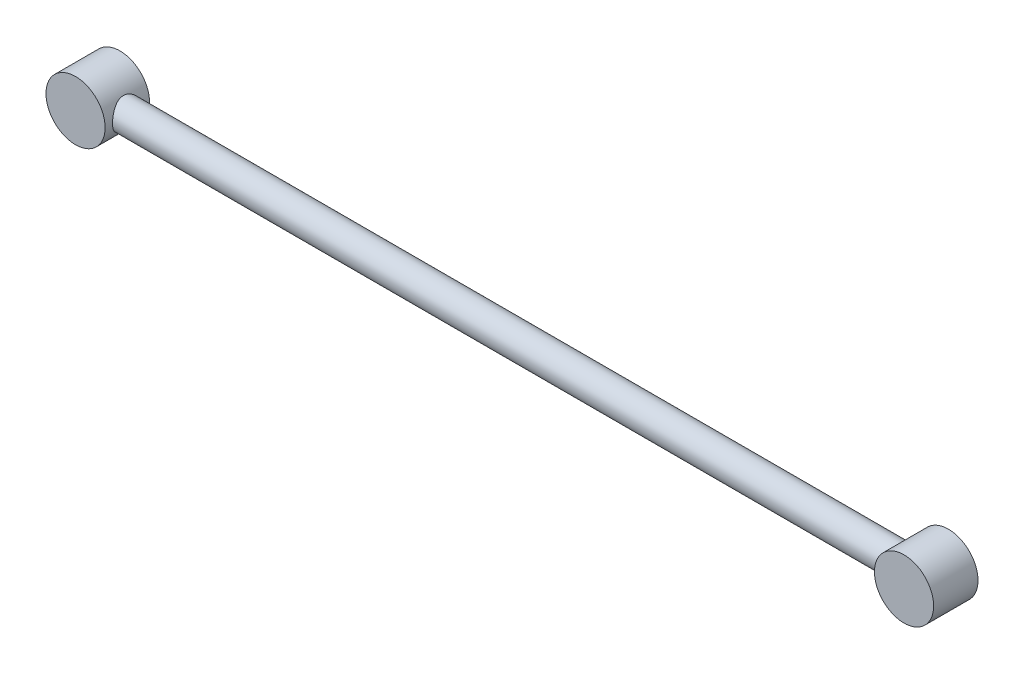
ISO-10303-21;
HEADER;
FILE_DESCRIPTION(('STEP AP214'),'2;1');
FILE_NAME('part.step','',(''),(''),'','','');
FILE_SCHEMA(('AUTOMOTIVE_DESIGN { 1 0 10303 214 1 1 1 1 }'));
ENDSEC;
DATA;
#1=APPLICATION_CONTEXT('core data for automotive mechanical design processes');
#2=APPLICATION_PROTOCOL_DEFINITION('international standard','automotive_design',2000,#1);
#3=PRODUCT_CONTEXT('',#1,'mechanical');
#4=PRODUCT('Part','Part','',(#3));
#5=PRODUCT_RELATED_PRODUCT_CATEGORY('part','',(#4));
#6=PRODUCT_DEFINITION_FORMATION('','',#4);
#7=PRODUCT_DEFINITION_CONTEXT('part definition',#1,'design');
#8=PRODUCT_DEFINITION('design','',#6,#7);
#9=PRODUCT_DEFINITION_SHAPE('','',#8);
#10=(LENGTH_UNIT() NAMED_UNIT(*) SI_UNIT(.MILLI.,.METRE.));
#11=(NAMED_UNIT(*) PLANE_ANGLE_UNIT() SI_UNIT($,.RADIAN.));
#12=(NAMED_UNIT(*) SI_UNIT($,.STERADIAN.) SOLID_ANGLE_UNIT());
#13=UNCERTAINTY_MEASURE_WITH_UNIT(LENGTH_MEASURE(1.E-05),#10,'distance_accuracy_value','');
#14=(GEOMETRIC_REPRESENTATION_CONTEXT(3) GLOBAL_UNCERTAINTY_ASSIGNED_CONTEXT((#13)) GLOBAL_UNIT_ASSIGNED_CONTEXT((#10,
#11,#12)) REPRESENTATION_CONTEXT('',''));
#15=CARTESIAN_POINT('',(0.,0.,0.));
#16=DIRECTION('',(0.,0.,1.));
#17=DIRECTION('',(1.,0.,0.));
#18=AXIS2_PLACEMENT_3D('',#15,#16,#17);
#19=CARTESIAN_POINT('',(-177.8,0.,9.52499999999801));
#20=DIRECTION('',(0.,0.,-1.));
#21=DIRECTION('',(-1.,0.,0.));
#22=AXIS2_PLACEMENT_3D('',#19,#20,#21);
#23=CYLINDRICAL_SURFACE('',#22,12.7);
#24=CARTESIAN_POINT('',(-165.099999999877,0.,-6.34999999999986));
#25=CARTESIAN_POINT('',(-165.100000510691,0.166990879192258,-6.34999944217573));
#26=CARTESIAN_POINT('',(-165.103301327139,0.333993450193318,-6.34340517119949));
#27=CARTESIAN_POINT('',(-165.116421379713,0.66676852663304,-6.31710332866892));
#28=CARTESIAN_POINT('',(-165.126243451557,0.832540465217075,-6.29739005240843));
#29=CARTESIAN_POINT('',(-165.152170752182,1.16177467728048,-6.24504620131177));
#30=CARTESIAN_POINT('',(-165.16828494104,1.32523331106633,-6.2123972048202));
#31=CARTESIAN_POINT('',(-165.206391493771,1.64849348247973,-6.13454367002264));
#32=CARTESIAN_POINT('',(-165.228386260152,1.80829349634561,-6.08933399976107));
#33=CARTESIAN_POINT('',(-165.277604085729,2.1224418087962,-5.98706118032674));
#34=CARTESIAN_POINT('',(-165.304804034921,2.2768107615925,-5.93005033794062));
#35=CARTESIAN_POINT('',(-165.363849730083,2.57993454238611,-5.80460027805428));
#36=CARTESIAN_POINT('',(-165.395697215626,2.72868724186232,-5.73615677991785));
#37=CARTESIAN_POINT('',(-165.497118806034,3.16512812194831,-5.51459167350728));
#38=CARTESIAN_POINT('',(-165.572628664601,3.4433450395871,-5.3451216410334));
#39=CARTESIAN_POINT('',(-165.737781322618,3.98471796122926,-4.95605749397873));
#40=CARTESIAN_POINT('',(-165.828002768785,4.2459445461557,-4.73405124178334));
#41=CARTESIAN_POINT('',(-166.010603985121,4.72936553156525,-4.25114819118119));
#42=CARTESIAN_POINT('',(-166.102985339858,4.95153018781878,-3.99022203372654));
#43=CARTESIAN_POINT('',(-166.239675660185,5.25955398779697,-3.56282486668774));
#44=CARTESIAN_POINT('',(-166.286527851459,5.36106270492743,-3.40820389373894));
#45=CARTESIAN_POINT('',(-166.376690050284,5.55058368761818,-3.08994761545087));
#46=CARTESIAN_POINT('',(-166.420001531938,5.63860158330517,-2.92631610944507));
#47=CARTESIAN_POINT('',(-166.501590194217,5.80035808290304,-2.59094786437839));
#48=CARTESIAN_POINT('',(-166.539867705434,5.87409762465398,-2.41921165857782));
#49=CARTESIAN_POINT('',(-166.609911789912,6.00645788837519,-2.06881694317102));
#50=CARTESIAN_POINT('',(-166.641682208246,6.06508754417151,-1.89016259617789));
#51=CARTESIAN_POINT('',(-166.695740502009,6.16347180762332,-1.53802379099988));
#52=CARTESIAN_POINT('',(-166.718480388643,6.20414249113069,-1.36486498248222));
#53=CARTESIAN_POINT('',(-166.756119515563,6.2708994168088,-1.014910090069));
#54=CARTESIAN_POINT('',(-166.771019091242,6.29698628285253,-0.838114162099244));
#55=CARTESIAN_POINT('',(-166.792323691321,6.33415533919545,-0.482590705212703));
#56=CARTESIAN_POINT('',(-166.79873590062,6.34525022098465,-0.303864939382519));
#57=CARTESIAN_POINT('',(-166.802799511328,6.35229110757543,0.0539765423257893));
#58=CARTESIAN_POINT('',(-166.800451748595,6.34823855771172,0.233092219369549));
#59=CARTESIAN_POINT('',(-166.787909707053,6.32645177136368,0.568582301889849));
#60=CARTESIAN_POINT('',(-166.77869041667,6.31041699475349,0.725107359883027));
#61=CARTESIAN_POINT('',(-166.753871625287,6.26687134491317,1.03609053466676));
#62=CARTESIAN_POINT('',(-166.738270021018,6.23935668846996,1.1905479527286));
#63=CARTESIAN_POINT('',(-166.701197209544,6.17316873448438,1.4963112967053));
#64=CARTESIAN_POINT('',(-166.679726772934,6.13449690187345,1.64761763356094));
#65=CARTESIAN_POINT('',(-166.631580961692,6.04639785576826,1.94623864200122));
#66=CARTESIAN_POINT('',(-166.604903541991,5.99696641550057,2.09355171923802));
#67=CARTESIAN_POINT('',(-166.516862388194,5.83067999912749,2.53492872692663));
#68=CARTESIAN_POINT('',(-166.44837434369,5.69733157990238,2.82155056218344));
#69=CARTESIAN_POINT('',(-166.299928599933,5.39139880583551,3.36957685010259));
#70=CARTESIAN_POINT('',(-166.219965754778,5.21879682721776,3.63096990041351));
#71=CARTESIAN_POINT('',(-166.045318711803,4.81373716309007,4.15618743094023));
#72=CARTESIAN_POINT('',(-165.950053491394,4.57646495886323,4.41611767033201));
#73=CARTESIAN_POINT('',(-165.763714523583,4.06112275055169,4.89420340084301));
#74=CARTESIAN_POINT('',(-165.672642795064,3.78303336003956,5.11233892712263));
#75=CARTESIAN_POINT('',(-165.544061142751,3.33286643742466,5.40822137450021));
#76=CARTESIAN_POINT('',(-165.501694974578,3.17335722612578,5.50335984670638));
#77=CARTESIAN_POINT('',(-165.421778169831,2.84569771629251,5.67970671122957));
#78=CARTESIAN_POINT('',(-165.384225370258,2.67755134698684,5.76092136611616));
#79=CARTESIAN_POINT('',(-165.315042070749,2.3337876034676,5.90854657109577));
#80=CARTESIAN_POINT('',(-165.283409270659,2.15817316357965,5.97496287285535));
#81=CARTESIAN_POINT('',(-165.227012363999,1.8007480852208,6.09222165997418));
#82=CARTESIAN_POINT('',(-165.202247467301,1.61893816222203,6.14306593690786));
#83=CARTESIAN_POINT('',(-165.162108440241,1.26593635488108,6.22494695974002));
#84=CARTESIAN_POINT('',(-165.146126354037,1.09511243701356,6.25727558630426));
#85=CARTESIAN_POINT('',(-165.121043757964,0.750891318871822,6.30784558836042));
#86=CARTESIAN_POINT('',(-165.111942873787,0.577494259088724,6.32608773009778));
#87=CARTESIAN_POINT('',(-165.100884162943,0.229629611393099,6.34823872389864));
#88=CARTESIAN_POINT('',(-165.098923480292,0.0551624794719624,6.35215330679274));
#89=CARTESIAN_POINT('',(-165.102194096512,-0.293430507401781,6.34561139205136));
#90=CARTESIAN_POINT('',(-165.107425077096,-0.467556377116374,6.33515553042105));
#91=CARTESIAN_POINT('',(-165.124244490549,-0.800509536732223,6.30138636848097));
#92=CARTESIAN_POINT('',(-165.135306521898,-0.959472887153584,6.27913692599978));
#93=CARTESIAN_POINT('',(-165.163154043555,-1.27482840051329,6.22277883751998));
#94=CARTESIAN_POINT('',(-165.179941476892,-1.43121967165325,6.18866616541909));
#95=CARTESIAN_POINT('',(-165.2188400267,-1.74030776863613,6.10895204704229));
#96=CARTESIAN_POINT('',(-165.240949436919,-1.89300576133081,6.06335428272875));
#97=CARTESIAN_POINT('',(-165.290002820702,-2.19390570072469,5.96108560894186));
#98=CARTESIAN_POINT('',(-165.316948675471,-2.34210587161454,5.90441038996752));
#99=CARTESIAN_POINT('',(-165.375904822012,-2.63725856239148,5.77873770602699));
#100=CARTESIAN_POINT('',(-165.408036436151,-2.7840582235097,5.70943799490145));
#101=CARTESIAN_POINT('',(-165.476074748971,-3.07126756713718,5.56021860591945));
#102=CARTESIAN_POINT('',(-165.511982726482,-3.21167506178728,5.48029532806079));
#103=CARTESIAN_POINT('',(-165.624225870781,-3.62227376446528,5.22545088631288));
#104=CARTESIAN_POINT('',(-165.705112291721,-3.88199540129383,5.03538892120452));
#105=CARTESIAN_POINT('',(-165.880550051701,-4.39279994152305,4.59886015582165));
#106=CARTESIAN_POINT('',(-165.975663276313,-4.64052990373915,4.34868719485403));
#107=CARTESIAN_POINT('',(-166.116022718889,-4.97892395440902,3.94508991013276));
#108=CARTESIAN_POINT('',(-166.16245674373,-5.08625380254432,3.80572389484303));
#109=CARTESIAN_POINT('',(-166.253326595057,-5.28929908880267,3.51806625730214));
#110=CARTESIAN_POINT('',(-166.297762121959,-5.3850127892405,3.36977330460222));
#111=CARTESIAN_POINT('',(-166.385416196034,-5.56849389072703,3.05757189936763));
#112=CARTESIAN_POINT('',(-166.428469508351,-5.65564549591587,2.89325455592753));
#113=CARTESIAN_POINT('',(-166.509420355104,-5.81556909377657,2.55662946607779));
#114=CARTESIAN_POINT('',(-166.547320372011,-5.88834801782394,2.38432562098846));
#115=CARTESIAN_POINT('',(-166.616502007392,-6.01870593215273,2.0329208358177));
#116=CARTESIAN_POINT('',(-166.64778893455,-6.07629712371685,1.85382548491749));
#117=CARTESIAN_POINT('',(-166.702450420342,-6.17556605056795,1.49010166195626));
#118=CARTESIAN_POINT('',(-166.72582620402,-6.21724624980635,1.30547405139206));
#119=CARTESIAN_POINT('',(-166.761778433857,-6.28083303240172,0.950261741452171));
#120=CARTESIAN_POINT('',(-166.775176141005,-6.30425367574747,0.780030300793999));
#121=CARTESIAN_POINT('',(-166.794093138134,-6.33722186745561,0.437794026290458));
#122=CARTESIAN_POINT('',(-166.79961296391,-6.34677035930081,0.265789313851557));
#123=CARTESIAN_POINT('',(-166.802543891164,-6.35184755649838,-0.0784312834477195));
#124=CARTESIAN_POINT('',(-166.799957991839,-6.34738144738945,-0.250647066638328));
#125=CARTESIAN_POINT('',(-166.78679264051,-6.32451076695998,-0.59383366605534));
#126=CARTESIAN_POINT('',(-166.776213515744,-6.30610676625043,-0.764804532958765));
#127=CARTESIAN_POINT('',(-166.748868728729,-6.25804920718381,-1.08782968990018));
#128=CARTESIAN_POINT('',(-166.732791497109,-6.22963986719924,-1.2401293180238));
#129=CARTESIAN_POINT('',(-166.694973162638,-6.16196939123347,-1.54160036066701));
#130=CARTESIAN_POINT('',(-166.673230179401,-6.12270465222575,-1.69077071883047));
#131=CARTESIAN_POINT('',(-166.600451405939,-5.98919755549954,-2.13222433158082));
#132=CARTESIAN_POINT('',(-166.541846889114,-5.87921095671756,-2.41865701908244));
#133=CARTESIAN_POINT('',(-166.406284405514,-5.61221709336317,-2.98851600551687));
#134=CARTESIAN_POINT('',(-166.328357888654,-5.45254719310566,-3.27044739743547));
#135=CARTESIAN_POINT('',(-166.164560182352,-5.09367320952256,-3.80537307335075));
#136=CARTESIAN_POINT('',(-166.078684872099,-4.89444855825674,-4.05835219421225));
#137=CARTESIAN_POINT('',(-165.896130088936,-4.43354035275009,-4.5602382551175));
#138=CARTESIAN_POINT('',(-165.799405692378,-4.16720894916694,-4.80491543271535));
#139=CARTESIAN_POINT('',(-165.661668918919,-3.73813634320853,-5.13630604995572));
#140=CARTESIAN_POINT('',(-165.616947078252,-3.59004569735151,-5.24090509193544));
#141=CARTESIAN_POINT('',(-165.531112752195,-3.28473589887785,-5.4374551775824));
#142=CARTESIAN_POINT('',(-165.489998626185,-3.12752095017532,-5.52941198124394));
#143=CARTESIAN_POINT('',(-165.412194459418,-2.80361177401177,-5.70053310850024));
#144=CARTESIAN_POINT('',(-165.37554080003,-2.6368540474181,-5.7795938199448));
#145=CARTESIAN_POINT('',(-165.308088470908,-2.29614399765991,-5.92320628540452));
#146=CARTESIAN_POINT('',(-165.277286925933,-2.12219525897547,-5.98776516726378));
#147=CARTESIAN_POINT('',(-165.222499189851,-1.76872534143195,-6.1015167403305));
#148=CARTESIAN_POINT('',(-165.198498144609,-1.58921727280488,-6.15074294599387));
#149=CARTESIAN_POINT('',(-165.157980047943,-1.22585054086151,-6.23333526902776));
#150=CARTESIAN_POINT('',(-165.14145842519,-1.0419946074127,-6.26671107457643));
#151=CARTESIAN_POINT('',(-165.119349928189,-0.715063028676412,-6.31123256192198));
#152=CARTESIAN_POINT('',(-165.112106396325,-0.572548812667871,-6.3257579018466));
#153=CARTESIAN_POINT('',(-165.102431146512,-0.286692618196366,-6.34514199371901));
#154=CARTESIAN_POINT('',(-165.099999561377,-0.143350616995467,-6.35000047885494));
#155=CARTESIAN_POINT('',(-165.099999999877,0.,-6.34999999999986));
#156=B_SPLINE_CURVE_WITH_KNOTS('',3,(#24,#25,#26,#27,#28,#29,#30,#31,#32,#33,#34,#35,#36,#37,
#38,#39,#40,#41,#42,#43,#44,#45,#46,#47,#48,#49,#50,#51,#52,#53,#54,#55,#56,#57,#58,#59,#60,#61,
#62,#63,#64,#65,#66,#67,#68,#69,#70,#71,#72,#73,#74,#75,#76,#77,#78,#79,#80,#81,#82,#83,#84,#85,
#86,#87,#88,#89,#90,#91,#92,#93,#94,#95,#96,#97,#98,#99,#100,#101,#102,#103,#104,#105,#106,#107,
#108,#109,#110,#111,#112,#113,#114,#115,#116,#117,#118,#119,#120,#121,#122,#123,#124,#125,#126,
#127,#128,#129,#130,#131,#132,#133,#134,#135,#136,#137,#138,#139,#140,#141,#142,#143,#144,#145,
#146,#147,#148,#149,#150,#151,#152,#153,#154,#155),.UNSPECIFIED.,.T.,.F.,(4,2,2,2,2,2,2,2,2,2,2,
2,2,2,2,2,2,2,2,2,2,2,2,2,2,2,2,2,2,2,2,2,2,2,2,2,2,2,2,2,2,2,2,2,2,2,2,2,2,2,2,2,2,2,2,2,2,2,2,
2,2,2,2,2,2,4),(0.,0.500831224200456,1.00188037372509,1.50364564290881,2.00561622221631,
2.50540779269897,3.00538691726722,4.00425210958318,5.0635463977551,6.12364383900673,
6.69546056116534,7.26703799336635,7.83857787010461,8.40977904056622,8.94696617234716,
9.48413032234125,10.0208394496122,10.5574973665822,11.0297819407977,11.5022222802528,
11.9746006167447,12.4471648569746,13.4133450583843,14.3799599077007,15.4691385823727,
16.5588362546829,17.1296896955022,17.7002857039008,18.2706595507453,18.840967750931,
19.3640345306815,19.8870728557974,20.4099019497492,20.9327079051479,21.4148301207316,
21.8971161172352,22.3792476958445,22.8615672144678,23.3574791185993,23.8535595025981,
24.8452132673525,25.9342484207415,26.4795520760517,27.0249372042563,27.596939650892,
28.1686655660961,28.7399307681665,29.3111074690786,29.8274552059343,30.3437678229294,
30.8598894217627,31.3759898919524,31.8427315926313,32.3096283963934,33.2427989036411,
34.2386648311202,35.235049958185,36.3525027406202,36.9121724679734,37.4715863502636,
38.035294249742,38.5987244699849,39.1609143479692,39.7227601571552,40.1526787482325,
40.5826092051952),.UNSPECIFIED.);
#157=CARTESIAN_POINT('',(-165.099999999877,0.,-6.34999999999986));
#158=VERTEX_POINT('',#157);
#159=EDGE_CURVE('E54',#158,#158,#156,.T.);
#160=ORIENTED_EDGE('',*,*,#159,.F.);
#161=EDGE_LOOP('',(#160));
#162=FACE_BOUND('',#161,.T.);
#163=CARTESIAN_POINT('',(-177.8,0.,9.52499999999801));
#164=DIRECTION('',(0.,0.,1.));
#165=DIRECTION('',(1.,0.,0.));
#166=AXIS2_PLACEMENT_3D('',#163,#164,#165);
#167=CIRCLE('',#166,12.7);
#168=CARTESIAN_POINT('',(-165.1,0.,9.52499999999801));
#169=VERTEX_POINT('',#168);
#170=EDGE_CURVE('E12',#169,#169,#167,.T.);
#171=ORIENTED_EDGE('',*,*,#170,.F.);
#172=EDGE_LOOP('',(#171));
#173=FACE_BOUND('',#172,.T.);
#174=CARTESIAN_POINT('',(-177.8,0.,-9.52499999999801));
#175=DIRECTION('',(0.,0.,1.));
#176=DIRECTION('',(1.,0.,0.));
#177=AXIS2_PLACEMENT_3D('',#174,#175,#176);
#178=CIRCLE('',#177,12.7);
#179=CARTESIAN_POINT('',(-165.1,0.,-9.52499999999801));
#180=VERTEX_POINT('',#179);
#181=EDGE_CURVE('E47',#180,#180,#178,.T.);
#182=ORIENTED_EDGE('',*,*,#181,.T.);
#183=EDGE_LOOP('',(#182));
#184=FACE_BOUND('',#183,.T.);
#185=ADVANCED_FACE('F44',(#162,#173,#184),#23,.T.);
#186=CARTESIAN_POINT('',(-177.8,0.,9.52499999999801));
#187=DIRECTION('',(0.,0.,1.));
#188=DIRECTION('',(1.,0.,0.));
#189=AXIS2_PLACEMENT_3D('',#186,#187,#188);
#190=PLANE('',#189);
#191=ORIENTED_EDGE('',*,*,#170,.T.);
#192=EDGE_LOOP('',(#191));
#193=FACE_BOUND('',#192,.T.);
#194=ADVANCED_FACE('F72',(#193),#190,.T.);
#195=CARTESIAN_POINT('',(-177.8,0.,-9.52499999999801));
#196=DIRECTION('',(0.,0.,1.));
#197=DIRECTION('',(1.,0.,0.));
#198=AXIS2_PLACEMENT_3D('',#195,#196,#197);
#199=PLANE('',#198);
#200=ORIENTED_EDGE('',*,*,#181,.F.);
#201=EDGE_LOOP('',(#200));
#202=FACE_BOUND('',#201,.T.);
#203=ADVANCED_FACE('F74',(#202),#199,.F.);
#204=CARTESIAN_POINT('',(-500000.,0.,0.));
#205=DIRECTION('',(1.,0.,0.));
#206=DIRECTION('',(0.,0.,-1.));
#207=AXIS2_PLACEMENT_3D('',#204,#205,#206);
#208=CYLINDRICAL_SURFACE('',#207,6.35);
#209=ORIENTED_EDGE('',*,*,#159,.T.);
#210=EDGE_LOOP('',(#209));
#211=FACE_BOUND('',#210,.T.);
#212=CARTESIAN_POINT('',(165.099999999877,0.,6.34999999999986));
#213=CARTESIAN_POINT('',(165.100000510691,-0.166990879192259,6.34999944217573));
#214=CARTESIAN_POINT('',(165.103301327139,-0.33399345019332,6.34340517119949));
#215=CARTESIAN_POINT('',(165.116421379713,-0.666768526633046,6.31710332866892));
#216=CARTESIAN_POINT('',(165.126243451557,-0.832540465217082,6.29739005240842));
#217=CARTESIAN_POINT('',(165.152170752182,-1.16177467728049,6.24504620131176));
#218=CARTESIAN_POINT('',(165.16828494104,-1.32523331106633,6.2123972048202));
#219=CARTESIAN_POINT('',(165.206391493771,-1.64849348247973,6.13454367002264));
#220=CARTESIAN_POINT('',(165.228386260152,-1.80829349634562,6.08933399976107));
#221=CARTESIAN_POINT('',(165.277604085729,-2.1224418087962,5.98706118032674));
#222=CARTESIAN_POINT('',(165.304804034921,-2.27681076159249,5.93005033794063));
#223=CARTESIAN_POINT('',(165.363849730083,-2.57993454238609,5.80460027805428));
#224=CARTESIAN_POINT('',(165.395697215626,-2.72868724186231,5.73615677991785));
#225=CARTESIAN_POINT('',(165.497118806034,-3.1651281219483,5.51459167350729));
#226=CARTESIAN_POINT('',(165.572628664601,-3.44334503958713,5.34512164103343));
#227=CARTESIAN_POINT('',(165.737781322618,-3.98471796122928,4.95605749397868));
#228=CARTESIAN_POINT('',(165.828002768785,-4.24594454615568,4.73405124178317));
#229=CARTESIAN_POINT('',(166.010603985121,-4.72936553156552,4.25114819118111));
#230=CARTESIAN_POINT('',(166.102985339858,-4.95153018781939,3.99022203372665));
#231=CARTESIAN_POINT('',(166.239675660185,-5.25955398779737,3.56282486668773));
#232=CARTESIAN_POINT('',(166.286527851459,-5.3610627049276,3.40820389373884));
#233=CARTESIAN_POINT('',(166.376690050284,-5.55058368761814,3.08994761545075));
#234=CARTESIAN_POINT('',(166.420001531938,-5.63860158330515,2.926316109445));
#235=CARTESIAN_POINT('',(166.501590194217,-5.80035808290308,2.59094786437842));
#236=CARTESIAN_POINT('',(166.539867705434,-5.87409762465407,2.41921165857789));
#237=CARTESIAN_POINT('',(166.609911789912,-6.00645788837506,2.06881694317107));
#238=CARTESIAN_POINT('',(166.641682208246,-6.0650875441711,1.89016259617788));
#239=CARTESIAN_POINT('',(166.695740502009,-6.16347180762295,1.53802379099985));
#240=CARTESIAN_POINT('',(166.718480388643,-6.20414249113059,1.36486498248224));
#241=CARTESIAN_POINT('',(166.756119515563,-6.27089941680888,1.01491009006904));
#242=CARTESIAN_POINT('',(166.771019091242,-6.29698628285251,0.83811416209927));
#243=CARTESIAN_POINT('',(166.792323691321,-6.33415533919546,0.482590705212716));
#244=CARTESIAN_POINT('',(166.79873590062,-6.34525022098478,0.303864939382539));
#245=CARTESIAN_POINT('',(166.802799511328,-6.35229110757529,-0.0539765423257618));
#246=CARTESIAN_POINT('',(166.800451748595,-6.3482385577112,-0.233092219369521));
#247=CARTESIAN_POINT('',(166.787909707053,-6.3264517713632,-0.568582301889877));
#248=CARTESIAN_POINT('',(166.77869041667,-6.31041699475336,-0.725107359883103));
#249=CARTESIAN_POINT('',(166.753871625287,-6.26687134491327,-1.03609053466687));
#250=CARTESIAN_POINT('',(166.738270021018,-6.23935668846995,-1.19054795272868));
#251=CARTESIAN_POINT('',(166.701197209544,-6.17316873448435,-1.4963112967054));
#252=CARTESIAN_POINT('',(166.679726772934,-6.13449690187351,-1.64761763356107));
#253=CARTESIAN_POINT('',(166.631580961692,-6.04639785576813,-1.94623864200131));
#254=CARTESIAN_POINT('',(166.604903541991,-5.99696641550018,-2.09355171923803));
#255=CARTESIAN_POINT('',(166.516862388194,-5.83067999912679,-2.53492872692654));
#256=CARTESIAN_POINT('',(166.44837434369,-5.69733157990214,-2.82155056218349));
#257=CARTESIAN_POINT('',(166.299928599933,-5.39139880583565,-3.36957685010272));
#258=CARTESIAN_POINT('',(166.219965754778,-5.2187968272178,-3.63096990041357));
#259=CARTESIAN_POINT('',(166.045318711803,-4.81373716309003,-4.15618743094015));
#260=CARTESIAN_POINT('',(165.950053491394,-4.57646495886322,-4.41611767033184));
#261=CARTESIAN_POINT('',(165.763714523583,-4.06112275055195,-4.89420340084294));
#262=CARTESIAN_POINT('',(165.672642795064,-3.78303336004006,-5.11233892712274));
#263=CARTESIAN_POINT('',(165.544061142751,-3.33286643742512,-5.40822137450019));
#264=CARTESIAN_POINT('',(165.501694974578,-3.17335722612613,-5.50335984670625));
#265=CARTESIAN_POINT('',(165.421778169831,-2.84569771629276,-5.67970671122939));
#266=CARTESIAN_POINT('',(165.384225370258,-2.67755134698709,-5.76092136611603));
#267=CARTESIAN_POINT('',(165.315042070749,-2.3337876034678,-5.90854657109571));
#268=CARTESIAN_POINT('',(165.283409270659,-2.15817316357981,-5.9749628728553));
#269=CARTESIAN_POINT('',(165.227012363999,-1.80074808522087,-6.09222165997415));
#270=CARTESIAN_POINT('',(165.202247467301,-1.61893816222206,-6.14306593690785));
#271=CARTESIAN_POINT('',(165.162108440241,-1.26593635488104,-6.22494695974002));
#272=CARTESIAN_POINT('',(165.146126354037,-1.09511243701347,-6.25727558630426));
#273=CARTESIAN_POINT('',(165.121043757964,-0.750891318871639,-6.30784558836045));
#274=CARTESIAN_POINT('',(165.111942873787,-0.577494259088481,-6.32608773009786));
#275=CARTESIAN_POINT('',(165.100884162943,-0.229629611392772,-6.3482387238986));
#276=CARTESIAN_POINT('',(165.098923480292,-0.0551624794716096,-6.35215330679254));
#277=CARTESIAN_POINT('',(165.102194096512,0.29343050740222,-6.34561139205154));
#278=CARTESIAN_POINT('',(165.107425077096,0.467556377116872,-6.33515553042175));
#279=CARTESIAN_POINT('',(165.124244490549,0.800509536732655,-6.30138636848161));
#280=CARTESIAN_POINT('',(165.135306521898,0.959472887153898,-6.27913692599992));
#281=CARTESIAN_POINT('',(165.163154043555,1.27482840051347,-6.22277883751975));
#282=CARTESIAN_POINT('',(165.179941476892,1.43121967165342,-6.188666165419));
#283=CARTESIAN_POINT('',(165.2188400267,1.74030776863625,-6.10895204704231));
#284=CARTESIAN_POINT('',(165.240949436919,1.8930057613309,-6.06335428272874));
#285=CARTESIAN_POINT('',(165.290002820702,2.19390570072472,-5.96108560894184));
#286=CARTESIAN_POINT('',(165.316948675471,2.34210587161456,-5.90441038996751));
#287=CARTESIAN_POINT('',(165.375904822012,2.63725856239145,-5.778737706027));
#288=CARTESIAN_POINT('',(165.408036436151,2.78405822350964,-5.70943799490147));
#289=CARTESIAN_POINT('',(165.476074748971,3.07126756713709,-5.5602186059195));
#290=CARTESIAN_POINT('',(165.511982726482,3.21167506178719,-5.48029532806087));
#291=CARTESIAN_POINT('',(165.624225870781,3.62227376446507,-5.22545088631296));
#292=CARTESIAN_POINT('',(165.705112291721,3.88199540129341,-5.03538892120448));
#293=CARTESIAN_POINT('',(165.880550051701,4.3927999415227,-4.5988601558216));
#294=CARTESIAN_POINT('',(165.975663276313,4.64052990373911,-4.34868719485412));
#295=CARTESIAN_POINT('',(166.116022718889,4.97892395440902,-3.94508991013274));
#296=CARTESIAN_POINT('',(166.16245674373,5.08625380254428,-3.80572389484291));
#297=CARTESIAN_POINT('',(166.253326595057,5.28929908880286,-3.51806625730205));
#298=CARTESIAN_POINT('',(166.297762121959,5.38501278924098,-3.36977330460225));
#299=CARTESIAN_POINT('',(166.385416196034,5.56849389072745,-3.05757189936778));
#300=CARTESIAN_POINT('',(166.428469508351,5.65564549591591,-2.89325455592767));
#301=CARTESIAN_POINT('',(166.509420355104,5.81556909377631,-2.55662946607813));
#302=CARTESIAN_POINT('',(166.547320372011,5.88834801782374,-2.384325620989));
#303=CARTESIAN_POINT('',(166.616502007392,6.0187059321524,-2.03292083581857));
#304=CARTESIAN_POINT('',(166.64778893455,6.07629712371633,-1.85382548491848));
#305=CARTESIAN_POINT('',(166.702450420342,6.1755660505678,-1.49010166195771));
#306=CARTESIAN_POINT('',(166.72582620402,6.21724624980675,-1.30547405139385));
#307=CARTESIAN_POINT('',(166.761778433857,6.28083303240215,-0.950261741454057));
#308=CARTESIAN_POINT('',(166.775176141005,6.30425367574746,-0.780030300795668));
#309=CARTESIAN_POINT('',(166.794093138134,6.33722186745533,-0.437794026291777));
#310=CARTESIAN_POINT('',(166.79961296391,6.34677035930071,-0.265789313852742));
#311=CARTESIAN_POINT('',(166.802543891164,6.35184755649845,0.0784312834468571));
#312=CARTESIAN_POINT('',(166.799957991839,6.3473814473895,0.250647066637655));
#313=CARTESIAN_POINT('',(166.78679264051,6.32451076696,0.593833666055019));
#314=CARTESIAN_POINT('',(166.776213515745,6.30610676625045,0.764804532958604));
#315=CARTESIAN_POINT('',(166.748868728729,6.25804920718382,1.08782968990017));
#316=CARTESIAN_POINT('',(166.732791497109,6.22963986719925,1.24012931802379));
#317=CARTESIAN_POINT('',(166.694973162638,6.16196939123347,1.54160036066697));
#318=CARTESIAN_POINT('',(166.673230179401,6.12270465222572,1.69077071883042));
#319=CARTESIAN_POINT('',(166.600451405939,5.98919755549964,2.13222433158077));
#320=CARTESIAN_POINT('',(166.541846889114,5.87921095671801,2.41865701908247));
#321=CARTESIAN_POINT('',(166.406284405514,5.6122170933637,2.98851600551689));
#322=CARTESIAN_POINT('',(166.328357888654,5.45254719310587,3.27044739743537));
#323=CARTESIAN_POINT('',(166.164560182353,5.09367320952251,3.80537307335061));
#324=CARTESIAN_POINT('',(166.078684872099,4.89444855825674,4.0583521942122));
#325=CARTESIAN_POINT('',(165.896130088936,4.43354035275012,4.56023825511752));
#326=CARTESIAN_POINT('',(165.799405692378,4.16720894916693,4.80491543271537));
#327=CARTESIAN_POINT('',(165.661668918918,3.73813634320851,5.13630604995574));
#328=CARTESIAN_POINT('',(165.616947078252,3.59004569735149,5.24090509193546));
#329=CARTESIAN_POINT('',(165.531112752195,3.28473589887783,5.43745517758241));
#330=CARTESIAN_POINT('',(165.489998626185,3.12752095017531,5.52941198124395));
#331=CARTESIAN_POINT('',(165.412194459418,2.80361177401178,5.70053310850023));
#332=CARTESIAN_POINT('',(165.37554080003,2.6368540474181,5.7795938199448));
#333=CARTESIAN_POINT('',(165.308088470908,2.29614399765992,5.92320628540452));
#334=CARTESIAN_POINT('',(165.277286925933,2.12219525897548,5.98776516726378));
#335=CARTESIAN_POINT('',(165.222499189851,1.76872534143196,6.10151674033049));
#336=CARTESIAN_POINT('',(165.198498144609,1.58921727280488,6.15074294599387));
#337=CARTESIAN_POINT('',(165.157980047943,1.22585054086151,6.23333526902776));
#338=CARTESIAN_POINT('',(165.14145842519,1.0419946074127,6.26671107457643));
#339=CARTESIAN_POINT('',(165.119349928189,0.715063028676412,6.31123256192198));
#340=CARTESIAN_POINT('',(165.112106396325,0.572548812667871,6.3257579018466));
#341=CARTESIAN_POINT('',(165.102431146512,0.286692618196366,6.34514199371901));
#342=CARTESIAN_POINT('',(165.099999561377,0.143350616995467,6.35000047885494));
#343=CARTESIAN_POINT('',(165.099999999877,0.,6.34999999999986));
#344=B_SPLINE_CURVE_WITH_KNOTS('',3,(#212,#213,#214,#215,#216,#217,#218,#219,#220,#221,#222,
#223,#224,#225,#226,#227,#228,#229,#230,#231,#232,#233,#234,#235,#236,#237,#238,#239,#240,#241,
#242,#243,#244,#245,#246,#247,#248,#249,#250,#251,#252,#253,#254,#255,#256,#257,#258,#259,#260,
#261,#262,#263,#264,#265,#266,#267,#268,#269,#270,#271,#272,#273,#274,#275,#276,#277,#278,#279,
#280,#281,#282,#283,#284,#285,#286,#287,#288,#289,#290,#291,#292,#293,#294,#295,#296,#297,#298,
#299,#300,#301,#302,#303,#304,#305,#306,#307,#308,#309,#310,#311,#312,#313,#314,#315,#316,#317,
#318,#319,#320,#321,#322,#323,#324,#325,#326,#327,#328,#329,#330,#331,#332,#333,#334,#335,#336,
#337,#338,#339,#340,#341,#342,#343),.UNSPECIFIED.,.T.,.F.,(4,2,2,2,2,2,2,2,2,2,2,2,2,2,2,2,2,2,
2,2,2,2,2,2,2,2,2,2,2,2,2,2,2,2,2,2,2,2,2,2,2,2,2,2,2,2,2,2,2,2,2,2,2,2,2,2,2,2,2,2,2,2,2,2,2,
4),(0.,0.50083122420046,1.0018803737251,1.50364564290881,2.00561622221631,2.50540779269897,
3.0053869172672,4.00425210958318,5.0635463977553,6.12364383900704,6.69546056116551,
7.26703799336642,7.8385778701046,8.40977904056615,8.94696617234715,9.48413032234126,
10.0208394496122,10.5574973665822,11.0297819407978,11.5022222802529,11.9746006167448,
12.4471648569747,13.4133450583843,14.3799599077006,15.4691385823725,16.5588362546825,
17.1296896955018,17.7002857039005,18.2706595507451,18.840967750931,19.3640345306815,
19.8870728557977,20.4099019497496,20.9327079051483,21.4148301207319,21.8971161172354,
22.3792476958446,22.8615672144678,23.3574791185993,23.8535595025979,24.8452132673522,
25.9342484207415,26.4795520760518,27.0249372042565,27.5969396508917,28.1686655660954,
28.7399307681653,29.3111074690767,29.8274552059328,30.3437678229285,30.8598894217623,
31.3759898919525,31.8427315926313,32.3096283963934,33.242798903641,34.2386648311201,
35.2350499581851,36.3525027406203,36.9121724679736,37.4715863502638,38.0352942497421,
38.598724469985,39.1609143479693,39.7227601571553,40.1526787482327,40.5826092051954),.UNSPECIFIED.);
#345=CARTESIAN_POINT('',(165.099999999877,0.,6.34999999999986));
#346=VERTEX_POINT('',#345);
#347=EDGE_CURVE('E62',#346,#346,#344,.T.);
#348=ORIENTED_EDGE('',*,*,#347,.F.);
#349=EDGE_LOOP('',(#348));
#350=FACE_BOUND('',#349,.T.);
#351=ADVANCED_FACE('F68',(#211,#350),#208,.T.);
#352=CARTESIAN_POINT('',(177.8,0.,9.52499999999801));
#353=DIRECTION('',(0.,0.,-1.));
#354=DIRECTION('',(-1.,0.,0.));
#355=AXIS2_PLACEMENT_3D('',#352,#353,#354);
#356=CYLINDRICAL_SURFACE('',#355,12.7);
#357=ORIENTED_EDGE('',*,*,#347,.T.);
#358=EDGE_LOOP('',(#357));
#359=FACE_BOUND('',#358,.T.);
#360=CARTESIAN_POINT('',(177.8,0.,9.52499999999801));
#361=DIRECTION('',(0.,0.,1.));
#362=DIRECTION('',(1.,0.,0.));
#363=AXIS2_PLACEMENT_3D('',#360,#361,#362);
#364=CIRCLE('',#363,12.7);
#365=CARTESIAN_POINT('',(190.5,0.,9.52499999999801));
#366=VERTEX_POINT('',#365);
#367=EDGE_CURVE('E94',#366,#366,#364,.T.);
#368=ORIENTED_EDGE('',*,*,#367,.F.);
#369=EDGE_LOOP('',(#368));
#370=FACE_BOUND('',#369,.T.);
#371=CARTESIAN_POINT('',(177.8,0.,-9.52499999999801));
#372=DIRECTION('',(0.,0.,1.));
#373=DIRECTION('',(1.,0.,0.));
#374=AXIS2_PLACEMENT_3D('',#371,#372,#373);
#375=CIRCLE('',#374,12.7);
#376=CARTESIAN_POINT('',(190.5,0.,-9.52499999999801));
#377=VERTEX_POINT('',#376);
#378=EDGE_CURVE('E96',#377,#377,#375,.T.);
#379=ORIENTED_EDGE('',*,*,#378,.T.);
#380=EDGE_LOOP('',(#379));
#381=FACE_BOUND('',#380,.T.);
#382=ADVANCED_FACE('F80',(#359,#370,#381),#356,.T.);
#383=CARTESIAN_POINT('',(177.8,0.,9.52499999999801));
#384=DIRECTION('',(0.,0.,1.));
#385=DIRECTION('',(1.,0.,0.));
#386=AXIS2_PLACEMENT_3D('',#383,#384,#385);
#387=PLANE('',#386);
#388=ORIENTED_EDGE('',*,*,#367,.T.);
#389=EDGE_LOOP('',(#388));
#390=FACE_BOUND('',#389,.T.);
#391=ADVANCED_FACE('F106',(#390),#387,.T.);
#392=CARTESIAN_POINT('',(177.8,0.,-9.52499999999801));
#393=DIRECTION('',(0.,0.,1.));
#394=DIRECTION('',(1.,0.,0.));
#395=AXIS2_PLACEMENT_3D('',#392,#393,#394);
#396=PLANE('',#395);
#397=ORIENTED_EDGE('',*,*,#378,.F.);
#398=EDGE_LOOP('',(#397));
#399=FACE_BOUND('',#398,.T.);
#400=ADVANCED_FACE('F104',(#399),#396,.F.);
#401=CLOSED_SHELL('',(#185,#194,#203,#351,#382,#391,#400));
#402=MANIFOLD_SOLID_BREP('B2',#401);
#403=ADVANCED_BREP_SHAPE_REPRESENTATION('',(#18,#402),#14);
#404=SHAPE_DEFINITION_REPRESENTATION(#9,#403);
ENDSEC;
END-ISO-10303-21;
